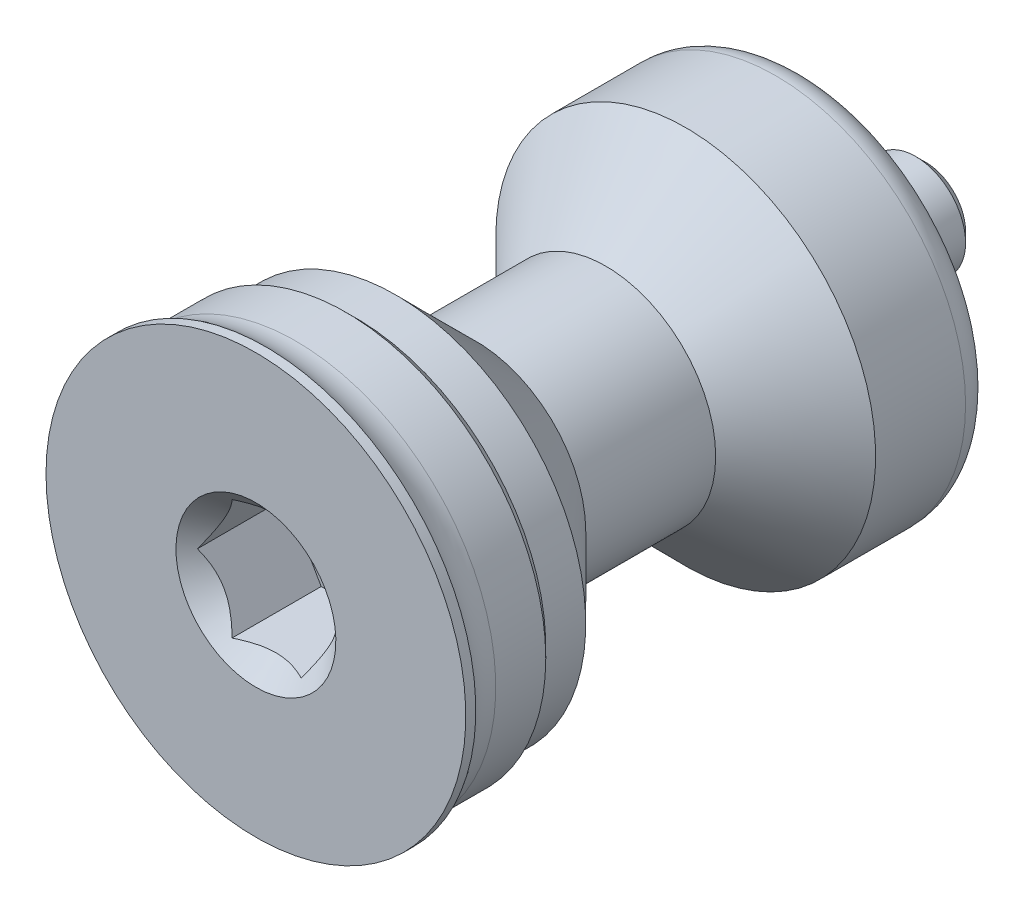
ISO-10303-21;
HEADER;
FILE_DESCRIPTION(('STEP AP214'),'2;1');
FILE_NAME('part.step','',(''),(''),'','','');
FILE_SCHEMA(('AUTOMOTIVE_DESIGN { 1 0 10303 214 1 1 1 1 }'));
ENDSEC;
DATA;
#1=APPLICATION_CONTEXT('core data for automotive mechanical design processes');
#2=APPLICATION_PROTOCOL_DEFINITION('international standard','automotive_design',2000,#1);
#3=PRODUCT_CONTEXT('',#1,'mechanical');
#4=PRODUCT('Part','Part','',(#3));
#5=PRODUCT_RELATED_PRODUCT_CATEGORY('part','',(#4));
#6=PRODUCT_DEFINITION_FORMATION('','',#4);
#7=PRODUCT_DEFINITION_CONTEXT('part definition',#1,'design');
#8=PRODUCT_DEFINITION('design','',#6,#7);
#9=PRODUCT_DEFINITION_SHAPE('','',#8);
#10=(LENGTH_UNIT() NAMED_UNIT(*) SI_UNIT(.MILLI.,.METRE.));
#11=(NAMED_UNIT(*) PLANE_ANGLE_UNIT() SI_UNIT($,.RADIAN.));
#12=(NAMED_UNIT(*) SI_UNIT($,.STERADIAN.) SOLID_ANGLE_UNIT());
#13=UNCERTAINTY_MEASURE_WITH_UNIT(LENGTH_MEASURE(1.E-05),#10,'distance_accuracy_value','');
#14=(GEOMETRIC_REPRESENTATION_CONTEXT(3) GLOBAL_UNCERTAINTY_ASSIGNED_CONTEXT((#13)) GLOBAL_UNIT_ASSIGNED_CONTEXT((#10,
#11,#12)) REPRESENTATION_CONTEXT('',''));
#15=CARTESIAN_POINT('',(0.,0.,0.));
#16=DIRECTION('',(0.,0.,1.));
#17=DIRECTION('',(1.,0.,0.));
#18=AXIS2_PLACEMENT_3D('',#15,#16,#17);
#19=CARTESIAN_POINT('',(0.,0.,25.5));
#20=DIRECTION('',(0.,0.,-1.));
#21=DIRECTION('',(-1.,0.,0.));
#22=AXIS2_PLACEMENT_3D('',#19,#20,#21);
#23=TOROIDAL_SURFACE('',#22,12.5,2.5);
#24=CARTESIAN_POINT('',(0.,0.,25.5));
#25=DIRECTION('',(0.,0.,-1.));
#26=DIRECTION('',(-1.,0.,0.));
#27=AXIS2_PLACEMENT_3D('',#24,#25,#26);
#28=CIRCLE('',#27,10.);
#29=CARTESIAN_POINT('',(-9.99999999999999,0.,25.5));
#30=VERTEX_POINT('',#29);
#31=EDGE_CURVE('E123',#30,#30,#28,.T.);
#32=ORIENTED_EDGE('',*,*,#31,.F.);
#33=EDGE_LOOP('',(#32));
#34=FACE_BOUND('',#33,.T.);
#35=CARTESIAN_POINT('',(0.,0.,27.));
#36=DIRECTION('',(0.,0.,-1.));
#37=DIRECTION('',(-1.,0.,0.));
#38=AXIS2_PLACEMENT_3D('',#35,#36,#37);
#39=CIRCLE('',#38,10.5);
#40=CARTESIAN_POINT('',(-10.5,0.,27.));
#41=VERTEX_POINT('',#40);
#42=EDGE_CURVE('E103',#41,#41,#39,.T.);
#43=ORIENTED_EDGE('',*,*,#42,.T.);
#44=EDGE_LOOP('',(#43));
#45=FACE_BOUND('',#44,.T.);
#46=ADVANCED_FACE('F14',(#34,#45),#23,.F.);
#47=CARTESIAN_POINT('',(0.,0.,-6.));
#48=DIRECTION('',(0.,0.,-1.));
#49=DIRECTION('',(-1.,0.,0.));
#50=AXIS2_PLACEMENT_3D('',#47,#48,#49);
#51=CYLINDRICAL_SURFACE('',#50,9.5);
#52=CARTESIAN_POINT('',(0.,0.,22.5));
#53=DIRECTION('',(0.,0.,-1.));
#54=DIRECTION('',(-1.,0.,0.));
#55=AXIS2_PLACEMENT_3D('',#52,#53,#54);
#56=CIRCLE('',#55,9.5);
#57=CARTESIAN_POINT('',(-9.49999999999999,0.,22.5));
#58=VERTEX_POINT('',#57);
#59=EDGE_CURVE('E126',#58,#58,#56,.T.);
#60=ORIENTED_EDGE('',*,*,#59,.T.);
#61=EDGE_LOOP('',(#60));
#62=FACE_BOUND('',#61,.T.);
#63=CARTESIAN_POINT('',(0.,0.,20.5));
#64=DIRECTION('',(0.,0.,-1.));
#65=DIRECTION('',(-1.,0.,0.));
#66=AXIS2_PLACEMENT_3D('',#63,#64,#65);
#67=CIRCLE('',#66,9.5);
#68=CARTESIAN_POINT('',(-9.5,0.,20.5));
#69=VERTEX_POINT('',#68);
#70=EDGE_CURVE('E107',#69,#69,#67,.T.);
#71=ORIENTED_EDGE('',*,*,#70,.F.);
#72=EDGE_LOOP('',(#71));
#73=FACE_BOUND('',#72,.T.);
#74=ADVANCED_FACE('F212',(#62,#73),#51,.T.);
#75=CARTESIAN_POINT('',(0.,0.,-6.));
#76=DIRECTION('',(0.,0.,-1.));
#77=DIRECTION('',(-1.,0.,0.));
#78=AXIS2_PLACEMENT_3D('',#75,#76,#77);
#79=CYLINDRICAL_SURFACE('',#78,10.);
#80=CARTESIAN_POINT('',(0.,0.,23.));
#81=DIRECTION('',(0.,0.,1.));
#82=DIRECTION('',(1.,0.,0.));
#83=AXIS2_PLACEMENT_3D('',#80,#81,#82);
#84=CIRCLE('',#83,10.);
#85=CARTESIAN_POINT('',(10.,0.,23.));
#86=VERTEX_POINT('',#85);
#87=EDGE_CURVE('E9',#86,#86,#84,.T.);
#88=ORIENTED_EDGE('',*,*,#87,.T.);
#89=EDGE_LOOP('',(#88));
#90=FACE_BOUND('',#89,.T.);
#91=ORIENTED_EDGE('',*,*,#31,.T.);
#92=EDGE_LOOP('',(#91));
#93=FACE_BOUND('',#92,.T.);
#94=ADVANCED_FACE('F218',(#90,#93),#79,.T.);
#95=CARTESIAN_POINT('',(0.,0.,6.));
#96=DIRECTION('',(0.,0.,-1.));
#97=DIRECTION('',(-1.,0.,0.));
#98=AXIS2_PLACEMENT_3D('',#95,#96,#97);
#99=CONICAL_SURFACE('',#98,9.5,0.78539816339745);
#100=CARTESIAN_POINT('',(0.,0.,10.));
#101=DIRECTION('',(0.,0.,-1.));
#102=DIRECTION('',(-1.,0.,0.));
#103=AXIS2_PLACEMENT_3D('',#100,#101,#102);
#104=CIRCLE('',#103,5.5);
#105=CARTESIAN_POINT('',(-5.5,0.,10.));
#106=VERTEX_POINT('',#105);
#107=EDGE_CURVE('E117',#106,#106,#104,.T.);
#108=ORIENTED_EDGE('',*,*,#107,.T.);
#109=EDGE_LOOP('',(#108));
#110=FACE_BOUND('',#109,.T.);
#111=CARTESIAN_POINT('',(0.,0.,6.));
#112=DIRECTION('',(0.,0.,-1.));
#113=DIRECTION('',(-1.,0.,0.));
#114=AXIS2_PLACEMENT_3D('',#111,#112,#113);
#115=CIRCLE('',#114,9.5);
#116=CARTESIAN_POINT('',(-9.5,0.,6.));
#117=VERTEX_POINT('',#116);
#118=EDGE_CURVE('E120',#117,#117,#115,.T.);
#119=ORIENTED_EDGE('',*,*,#118,.F.);
#120=EDGE_LOOP('',(#119));
#121=FACE_BOUND('',#120,.T.);
#122=ADVANCED_FACE('F226',(#110,#121),#99,.T.);
#123=CARTESIAN_POINT('',(0.,0.,0.));
#124=DIRECTION('',(0.,0.,-1.));
#125=DIRECTION('',(-1.,0.,0.));
#126=AXIS2_PLACEMENT_3D('',#123,#124,#125);
#127=CYLINDRICAL_SURFACE('',#126,5.5);
#128=CARTESIAN_POINT('',(0.,0.,16.5));
#129=DIRECTION('',(0.,0.,-1.));
#130=DIRECTION('',(-1.,0.,0.));
#131=AXIS2_PLACEMENT_3D('',#128,#129,#130);
#132=CIRCLE('',#131,5.5);
#133=CARTESIAN_POINT('',(-5.5,0.,16.5));
#134=VERTEX_POINT('',#133);
#135=EDGE_CURVE('E114',#134,#134,#132,.T.);
#136=ORIENTED_EDGE('',*,*,#135,.T.);
#137=EDGE_LOOP('',(#136));
#138=FACE_BOUND('',#137,.T.);
#139=ORIENTED_EDGE('',*,*,#107,.F.);
#140=EDGE_LOOP('',(#139));
#141=FACE_BOUND('',#140,.T.);
#142=ADVANCED_FACE('F240',(#138,#141),#127,.T.);
#143=CARTESIAN_POINT('',(0.,0.,16.5));
#144=DIRECTION('',(0.,0.,1.));
#145=DIRECTION('',(1.,0.,0.));
#146=AXIS2_PLACEMENT_3D('',#143,#144,#145);
#147=CONICAL_SURFACE('',#146,5.5,0.78539816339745);
#148=ORIENTED_EDGE('',*,*,#70,.T.);
#149=EDGE_LOOP('',(#148));
#150=FACE_BOUND('',#149,.T.);
#151=ORIENTED_EDGE('',*,*,#135,.F.);
#152=EDGE_LOOP('',(#151));
#153=FACE_BOUND('',#152,.T.);
#154=ADVANCED_FACE('F235',(#150,#153),#147,.T.);
#155=CARTESIAN_POINT('',(9.5,0.,0.));
#156=DIRECTION('',(0.,0.,1.));
#157=DIRECTION('',(1.,0.,0.));
#158=AXIS2_PLACEMENT_3D('',#155,#156,#157);
#159=PLANE('',#158);
#160=CARTESIAN_POINT('',(0.,0.,0.));
#161=DIRECTION('',(0.,0.,1.));
#162=DIRECTION('',(1.,0.,0.));
#163=AXIS2_PLACEMENT_3D('',#160,#161,#162);
#164=CIRCLE('',#163,3.);
#165=CARTESIAN_POINT('',(3.,0.,0.));
#166=VERTEX_POINT('',#165);
#167=EDGE_CURVE('E179',#166,#166,#164,.T.);
#168=ORIENTED_EDGE('',*,*,#167,.T.);
#169=EDGE_LOOP('',(#168));
#170=FACE_BOUND('',#169,.T.);
#171=CARTESIAN_POINT('',(0.,0.,0.));
#172=DIRECTION('',(0.,0.,1.));
#173=DIRECTION('',(1.,0.,0.));
#174=AXIS2_PLACEMENT_3D('',#171,#172,#173);
#175=CIRCLE('',#174,8.);
#176=CARTESIAN_POINT('',(8.,0.,0.));
#177=VERTEX_POINT('',#176);
#178=EDGE_CURVE('E164',#177,#177,#175,.F.);
#179=ORIENTED_EDGE('',*,*,#178,.T.);
#180=EDGE_LOOP('',(#179));
#181=FACE_BOUND('',#180,.T.);
#182=ADVANCED_FACE('F232',(#170,#181),#159,.F.);
#183=CARTESIAN_POINT('',(0.,0.,1.5));
#184=DIRECTION('',(0.,0.,1.));
#185=DIRECTION('',(1.,0.,0.));
#186=AXIS2_PLACEMENT_3D('',#183,#184,#185);
#187=CIRCLE('',#186,9.5);
#188=CARTESIAN_POINT('',(9.5,0.,1.5));
#189=VERTEX_POINT('',#188);
#190=EDGE_CURVE('E173',#189,#189,#187,.T.);
#191=ORIENTED_EDGE('',*,*,#190,.T.);
#192=EDGE_LOOP('',(#191));
#193=FACE_BOUND('',#192,.T.);
#194=ORIENTED_EDGE('',*,*,#118,.T.);
#195=EDGE_LOOP('',(#194));
#196=FACE_BOUND('',#195,.T.);
#197=ADVANCED_FACE('F221',(#193,#196),#51,.T.);
#198=CARTESIAN_POINT('',(0.,0.,-3.));
#199=DIRECTION('',(0.,0.,-1.));
#200=DIRECTION('',(-1.,0.,0.));
#201=AXIS2_PLACEMENT_3D('',#198,#199,#200);
#202=CONICAL_SURFACE('',#201,2.5,0.47123889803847);
#203=CARTESIAN_POINT('',(0.,0.,-2.01869474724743));
#204=DIRECTION('',(0.,0.,-1.));
#205=DIRECTION('',(-1.,0.,0.));
#206=AXIS2_PLACEMENT_3D('',#203,#204,#205);
#207=CIRCLE('',#206,2.);
#208=CARTESIAN_POINT('',(-2.,0.,-2.01869474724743));
#209=VERTEX_POINT('',#208);
#210=EDGE_CURVE('E98',#209,#209,#207,.T.);
#211=ORIENTED_EDGE('',*,*,#210,.T.);
#212=EDGE_LOOP('',(#211));
#213=FACE_BOUND('',#212,.T.);
#214=CARTESIAN_POINT('',(0.,0.,-3.));
#215=DIRECTION('',(0.,0.,-1.));
#216=DIRECTION('',(-1.,0.,0.));
#217=AXIS2_PLACEMENT_3D('',#214,#215,#216);
#218=CIRCLE('',#217,2.5);
#219=CARTESIAN_POINT('',(-2.5,0.,-3.));
#220=VERTEX_POINT('',#219);
#221=EDGE_CURVE('E104',#220,#220,#218,.T.);
#222=ORIENTED_EDGE('',*,*,#221,.F.);
#223=EDGE_LOOP('',(#222));
#224=FACE_BOUND('',#223,.T.);
#225=ADVANCED_FACE('F207',(#213,#224),#202,.T.);
#226=CARTESIAN_POINT('',(0.,0.,0.));
#227=DIRECTION('',(0.,0.,-1.));
#228=DIRECTION('',(-1.,0.,0.));
#229=AXIS2_PLACEMENT_3D('',#226,#227,#228);
#230=CYLINDRICAL_SURFACE('',#229,2.);
#231=CARTESIAN_POINT('',(0.,0.,-1.));
#232=DIRECTION('',(0.,0.,1.));
#233=DIRECTION('',(1.,0.,0.));
#234=AXIS2_PLACEMENT_3D('',#231,#232,#233);
#235=CIRCLE('',#234,2.);
#236=CARTESIAN_POINT('',(2.,0.,-1.));
#237=VERTEX_POINT('',#236);
#238=EDGE_CURVE('E176',#237,#237,#235,.F.);
#239=ORIENTED_EDGE('',*,*,#238,.T.);
#240=EDGE_LOOP('',(#239));
#241=FACE_BOUND('',#240,.T.);
#242=ORIENTED_EDGE('',*,*,#210,.F.);
#243=EDGE_LOOP('',(#242));
#244=FACE_BOUND('',#243,.T.);
#245=ADVANCED_FACE('F198',(#241,#244),#230,.T.);
#246=CARTESIAN_POINT('',(2.5,0.,-6.));
#247=DIRECTION('',(0.,0.,1.));
#248=DIRECTION('',(1.,0.,0.));
#249=AXIS2_PLACEMENT_3D('',#246,#247,#248);
#250=PLANE('',#249);
#251=CARTESIAN_POINT('',(0.,0.,-6.));
#252=DIRECTION('',(0.,0.,1.));
#253=DIRECTION('',(1.,0.,0.));
#254=AXIS2_PLACEMENT_3D('',#251,#252,#253);
#255=CIRCLE('',#254,2.);
#256=CARTESIAN_POINT('',(2.,0.,-6.));
#257=VERTEX_POINT('',#256);
#258=EDGE_CURVE('E182',#257,#257,#255,.F.);
#259=ORIENTED_EDGE('',*,*,#258,.T.);
#260=EDGE_LOOP('',(#259));
#261=FACE_BOUND('',#260,.T.);
#262=ADVANCED_FACE('F196',(#261),#250,.F.);
#263=CARTESIAN_POINT('',(0.,0.,-6.));
#264=DIRECTION('',(0.,0.,-1.));
#265=DIRECTION('',(-1.,0.,0.));
#266=AXIS2_PLACEMENT_3D('',#263,#264,#265);
#267=CYLINDRICAL_SURFACE('',#266,2.5);
#268=CARTESIAN_POINT('',(0.,0.,-5.5));
#269=DIRECTION('',(0.,0.,1.));
#270=DIRECTION('',(1.,0.,0.));
#271=AXIS2_PLACEMENT_3D('',#268,#269,#270);
#272=CIRCLE('',#271,2.5);
#273=CARTESIAN_POINT('',(2.5,0.,-5.5));
#274=VERTEX_POINT('',#273);
#275=EDGE_CURVE('E22',#274,#274,#272,.T.);
#276=ORIENTED_EDGE('',*,*,#275,.T.);
#277=EDGE_LOOP('',(#276));
#278=FACE_BOUND('',#277,.T.);
#279=ORIENTED_EDGE('',*,*,#221,.T.);
#280=EDGE_LOOP('',(#279));
#281=FACE_BOUND('',#280,.T.);
#282=ADVANCED_FACE('F187',(#278,#281),#267,.T.);
#283=CARTESIAN_POINT('',(0.,0.,0.));
#284=DIRECTION('',(0.,0.,-1.));
#285=DIRECTION('',(-1.,0.,0.));
#286=AXIS2_PLACEMENT_3D('',#283,#284,#285);
#287=CYLINDRICAL_SURFACE('',#286,10.5);
#288=CARTESIAN_POINT('',(0.,0.,27.5));
#289=DIRECTION('',(0.,0.,-1.));
#290=DIRECTION('',(-1.,0.,0.));
#291=AXIS2_PLACEMENT_3D('',#288,#289,#290);
#292=CIRCLE('',#291,10.5);
#293=CARTESIAN_POINT('',(-10.5,0.,27.5));
#294=VERTEX_POINT('',#293);
#295=EDGE_CURVE('E100',#294,#294,#292,.T.);
#296=ORIENTED_EDGE('',*,*,#295,.T.);
#297=EDGE_LOOP('',(#296));
#298=FACE_BOUND('',#297,.T.);
#299=ORIENTED_EDGE('',*,*,#42,.F.);
#300=EDGE_LOOP('',(#299));
#301=FACE_BOUND('',#300,.T.);
#302=ADVANCED_FACE('F205',(#298,#301),#287,.T.);
#303=CARTESIAN_POINT('',(0.,0.,27.5));
#304=DIRECTION('',(0.,0.,1.));
#305=DIRECTION('',(1.,0.,0.));
#306=AXIS2_PLACEMENT_3D('',#303,#304,#305);
#307=PLANE('',#306);
#308=CARTESIAN_POINT('',(0.,0.,27.5));
#309=DIRECTION('',(0.,0.,1.));
#310=DIRECTION('',(0.,-1.,0.));
#311=AXIS2_PLACEMENT_3D('',#308,#309,#310);
#312=CIRCLE('',#311,4.);
#313=CARTESIAN_POINT('',(0.,-4.,27.5));
#314=VERTEX_POINT('',#313);
#315=EDGE_CURVE('E95',#314,#314,#312,.T.);
#316=ORIENTED_EDGE('',*,*,#315,.F.);
#317=EDGE_LOOP('',(#316));
#318=FACE_BOUND('',#317,.T.);
#319=ORIENTED_EDGE('',*,*,#295,.F.);
#320=EDGE_LOOP('',(#319));
#321=FACE_BOUND('',#320,.T.);
#322=ADVANCED_FACE('F273',(#318,#321),#307,.T.);
#323=CARTESIAN_POINT('',(0.,0.,27.5));
#324=DIRECTION('',(0.,0.,1.));
#325=DIRECTION('',(0.,-1.,0.));
#326=AXIS2_PLACEMENT_3D('',#323,#324,#325);
#327=CONICAL_SURFACE('',#326,4.,0.78539816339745);
#328=CARTESIAN_POINT('',(1.73193533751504,3.0002,26.9642170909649));
#329=CARTESIAN_POINT('',(1.79147372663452,2.89707648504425,26.9047299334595));
#330=CARTESIAN_POINT('',(1.85200767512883,2.79222861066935,26.8487365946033));
#331=CARTESIAN_POINT('',(1.97544301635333,2.57843232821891,26.7462142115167));
#332=CARTESIAN_POINT('',(2.03835614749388,2.46946358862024,26.6997422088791));
#333=CARTESIAN_POINT('',(2.16521745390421,2.24973336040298,26.6201348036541));
#334=CARTESIAN_POINT('',(2.22913332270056,2.13902782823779,26.5867993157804));
#335=CARTESIAN_POINT('',(2.35837216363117,1.91517958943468,26.5354391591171));
#336=CARTESIAN_POINT('',(2.42369118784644,1.80204372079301,26.5173761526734));
#337=CARTESIAN_POINT('',(2.53626564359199,1.6070590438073,26.5010785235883));
#338=CARTESIAN_POINT('',(2.58337569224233,1.52546204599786,26.4986659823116));
#339=CARTESIAN_POINT('',(2.67751916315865,1.36240077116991,26.5027310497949));
#340=CARTESIAN_POINT('',(2.7245525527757,1.28093655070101,26.5092117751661));
#341=CARTESIAN_POINT('',(2.81817374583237,1.11877988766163,26.530693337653));
#342=CARTESIAN_POINT('',(2.86476099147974,1.0380884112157,26.545703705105));
#343=CARTESIAN_POINT('',(2.95713536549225,0.878091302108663,26.5834252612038));
#344=CARTESIAN_POINT('',(3.00292255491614,0.798785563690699,26.6061358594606));
#345=CARTESIAN_POINT('',(3.0842086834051,0.657993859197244,26.6528622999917));
#346=CARTESIAN_POINT('',(3.11988753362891,0.596196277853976,26.6756499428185));
#347=CARTESIAN_POINT('',(3.19060468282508,0.473710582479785,26.7248979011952));
#348=CARTESIAN_POINT('',(3.22564296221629,0.4130225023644,26.751358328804));
#349=CARTESIAN_POINT('',(3.29496858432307,0.292947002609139,26.8073586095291));
#350=CARTESIAN_POINT('',(3.3292578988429,0.233556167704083,26.8368887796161));
#351=CARTESIAN_POINT('',(3.39720147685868,0.115874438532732,26.8986407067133));
#352=CARTESIAN_POINT('',(3.43085611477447,0.0575828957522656,26.9308608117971));
#353=CARTESIAN_POINT('',(3.4642170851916,-0.000200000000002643,26.9642170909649));
#354=B_SPLINE_CURVE_WITH_KNOTS('',3,(#328,#329,#330,#331,#332,#333,#334,#335,#336,#337,#338,
#339,#340,#341,#342,#343,#344,#345,#346,#347,#348,#349,#350,#351,#352,#353),.UNSPECIFIED.,.F.,
.F.,(4,2,2,2,2,2,2,2,2,2,2,2,4),(0.,0.399603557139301,0.801535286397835,1.19708369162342,
1.59163620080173,1.87398941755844,2.15644160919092,2.43921001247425,2.72195674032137,
2.94657516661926,3.17120044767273,3.3951375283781,3.61893808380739),.UNSPECIFIED.);
#355=CARTESIAN_POINT('',(1.73205080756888,3.,26.9641016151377));
#356=VERTEX_POINT('',#355);
#357=CARTESIAN_POINT('',(3.46410161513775,0.,26.9641016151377));
#358=VERTEX_POINT('',#357);
#359=EDGE_CURVE('E129',#356,#358,#354,.T.);
#360=ORIENTED_EDGE('',*,*,#359,.T.);
#361=CARTESIAN_POINT('',(3.4642170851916,0.000199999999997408,26.9642170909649));
#362=CARTESIAN_POINT('',(3.40467869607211,-0.102923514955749,26.9047299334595));
#363=CARTESIAN_POINT('',(3.3441447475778,-0.207771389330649,26.8487365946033));
#364=CARTESIAN_POINT('',(3.2207094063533,-0.421567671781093,26.7462142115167));
#365=CARTESIAN_POINT('',(3.15779627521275,-0.530536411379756,26.6997422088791));
#366=CARTESIAN_POINT('',(3.03093496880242,-0.750266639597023,26.6201348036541));
#367=CARTESIAN_POINT('',(2.96701910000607,-0.860972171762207,26.5867993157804));
#368=CARTESIAN_POINT('',(2.83778025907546,-1.08482041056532,26.5354391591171));
#369=CARTESIAN_POINT('',(2.7724612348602,-1.19795627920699,26.5173761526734));
#370=CARTESIAN_POINT('',(2.65988677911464,-1.3929409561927,26.5010785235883));
#371=CARTESIAN_POINT('',(2.6127767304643,-1.47453795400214,26.4986659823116));
#372=CARTESIAN_POINT('',(2.51863325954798,-1.63759922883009,26.5027310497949));
#373=CARTESIAN_POINT('',(2.47159986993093,-1.71906344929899,26.5092117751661));
#374=CARTESIAN_POINT('',(2.37797867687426,-1.88122011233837,26.530693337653));
#375=CARTESIAN_POINT('',(2.33139143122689,-1.9619115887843,26.545703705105));
#376=CARTESIAN_POINT('',(2.23901705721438,-2.12190869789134,26.5834252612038));
#377=CARTESIAN_POINT('',(2.19322986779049,-2.2012144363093,26.6061358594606));
#378=CARTESIAN_POINT('',(2.11194373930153,-2.34200614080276,26.6528622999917));
#379=CARTESIAN_POINT('',(2.07626488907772,-2.40380372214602,26.6756499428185));
#380=CARTESIAN_POINT('',(2.00554773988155,-2.52628941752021,26.7248979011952));
#381=CARTESIAN_POINT('',(1.97050946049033,-2.5869774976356,26.751358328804));
#382=CARTESIAN_POINT('',(1.90118383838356,-2.70705299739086,26.8073586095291));
#383=CARTESIAN_POINT('',(1.86689452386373,-2.76644383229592,26.8368887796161));
#384=CARTESIAN_POINT('',(1.79895094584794,-2.88412556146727,26.8986407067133));
#385=CARTESIAN_POINT('',(1.76529630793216,-2.94241710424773,26.9308608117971));
#386=CARTESIAN_POINT('',(1.73193533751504,-3.0002,26.9642170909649));
#387=B_SPLINE_CURVE_WITH_KNOTS('',3,(#361,#362,#363,#364,#365,#366,#367,#368,#369,#370,#371,
#372,#373,#374,#375,#376,#377,#378,#379,#380,#381,#382,#383,#384,#385,#386),.UNSPECIFIED.,.F.,
.F.,(4,2,2,2,2,2,2,2,2,2,2,2,4),(0.,0.399603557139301,0.801535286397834,1.19708369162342,
1.59163620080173,1.87398941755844,2.15644160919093,2.43921001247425,2.72195674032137,
2.94657516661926,3.17120044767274,3.39513752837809,3.61893808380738),.UNSPECIFIED.);
#388=CARTESIAN_POINT('',(1.73205080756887,-3.,26.9641016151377));
#389=VERTEX_POINT('',#388);
#390=EDGE_CURVE('E29',#358,#389,#387,.T.);
#391=ORIENTED_EDGE('',*,*,#390,.T.);
#392=CARTESIAN_POINT('',(-4.37758920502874,-3.,28.8069093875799));
#393=CARTESIAN_POINT('',(-4.2674111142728,-3.,28.716048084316));
#394=CARTESIAN_POINT('',(-4.15671173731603,-3.,28.6258090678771));
#395=CARTESIAN_POINT('',(-3.93400120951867,-3.,28.4469083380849));
#396=CARTESIAN_POINT('',(-3.82198973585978,-3.,28.3582470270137));
#397=CARTESIAN_POINT('',(-3.59519525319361,-3.,28.1819119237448));
#398=CARTESIAN_POINT('',(-3.48039529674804,-3.,28.0942598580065));
#399=CARTESIAN_POINT('',(-3.2489191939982,-3.,27.921486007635));
#400=CARTESIAN_POINT('',(-3.13224323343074,-3.,27.8363639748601));
#401=CARTESIAN_POINT('',(-2.88518326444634,-3.,27.661244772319));
#402=CARTESIAN_POINT('',(-2.75456636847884,-3.,27.5715743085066));
#403=CARTESIAN_POINT('',(-2.4898618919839,-3.,27.3973671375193));
#404=CARTESIAN_POINT('',(-2.355773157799,-3.,27.3128321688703));
#405=CARTESIAN_POINT('',(-2.08400272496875,-3.,27.1511888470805));
#406=CARTESIAN_POINT('',(-1.94634079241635,-3.,27.0740475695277));
#407=CARTESIAN_POINT('',(-1.666054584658,-3.,26.9294801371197));
#408=CARTESIAN_POINT('',(-1.52343486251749,-3.,26.8620453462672));
#409=CARTESIAN_POINT('',(-1.2756469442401,-3.,26.7586271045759));
#410=CARTESIAN_POINT('',(-1.17190723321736,-3.,26.7192457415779));
#411=CARTESIAN_POINT('',(-0.961582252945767,-3.,26.6487820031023));
#412=CARTESIAN_POINT('',(-0.854996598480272,-3.,26.6177007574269));
#413=CARTESIAN_POINT('',(-0.641800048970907,-3.,26.5661810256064));
#414=CARTESIAN_POINT('',(-0.535244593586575,-3.,26.5455170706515));
#415=CARTESIAN_POINT('',(-0.320567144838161,-3.,26.5152100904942));
#416=CARTESIAN_POINT('',(-0.212445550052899,-3.,26.5055643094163));
#417=CARTESIAN_POINT('',(-0.00171488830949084,-3.,26.498253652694));
#418=CARTESIAN_POINT('',(0.100872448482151,-3.,26.4999627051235));
#419=CARTESIAN_POINT('',(0.305338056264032,-3.,26.5137721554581));
#420=CARTESIAN_POINT('',(0.407216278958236,-3.,26.5258732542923));
#421=CARTESIAN_POINT('',(0.611312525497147,-3.,26.5599624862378));
#422=CARTESIAN_POINT('',(0.713498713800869,-3.,26.5821380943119));
#423=CARTESIAN_POINT('',(0.915568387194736,-3.,26.6350847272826));
#424=CARTESIAN_POINT('',(1.0154518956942,-3.,26.6658556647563));
#425=CARTESIAN_POINT('',(1.31490686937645,-3.,26.7700818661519));
#426=CARTESIAN_POINT('',(1.51058763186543,-3.,26.8547390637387));
#427=CARTESIAN_POINT('',(1.79700915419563,-3.,26.9960481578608));
#428=CARTESIAN_POINT('',(1.89147149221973,-3.,27.0456457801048));
#429=CARTESIAN_POINT('',(2.07826448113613,-3.,27.1487133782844));
#430=CARTESIAN_POINT('',(2.17059549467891,-3.,27.2021826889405));
#431=CARTESIAN_POINT('',(2.34885309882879,-3.,27.3095016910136));
#432=CARTESIAN_POINT('',(2.43487067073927,-3.,27.3632019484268));
#433=CARTESIAN_POINT('',(2.60542960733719,-3.,27.4729084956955));
#434=CARTESIAN_POINT('',(2.68997086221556,-3.,27.5289149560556));
#435=CARTESIAN_POINT('',(2.85709507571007,-3.,27.642372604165));
#436=CARTESIAN_POINT('',(2.9396882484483,-3.,27.6998088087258));
#437=CARTESIAN_POINT('',(3.10373883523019,-3.,27.8162355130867));
#438=CARTESIAN_POINT('',(3.18519655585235,-3.,27.8752255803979));
#439=CARTESIAN_POINT('',(3.26617756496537,-3.,27.9348524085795));
#440=B_SPLINE_CURVE_WITH_KNOTS('',3,(#392,#393,#394,#395,#396,#397,#398,#399,#400,#401,#402,
#403,#404,#405,#406,#407,#408,#409,#410,#411,#412,#413,#414,#415,#416,#417,#418,#419,#420,#421,
#422,#423,#424,#425,#426,#427,#428,#429,#430,#431,#432,#433,#434,#435,#436,#437,#438,#439),
.UNSPECIFIED.,.F.,.F.,(4,2,2,2,2,2,2,2,2,2,2,2,2,2,2,2,2,2,2,2,2,2,2,4),(0.,0.428440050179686,
0.856987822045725,1.29026938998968,1.72350832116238,2.1987222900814,2.67409624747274,
3.14724406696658,3.61996828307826,3.95258153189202,4.28524003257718,4.61035100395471,
4.9353806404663,5.24264372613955,5.54992753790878,5.86317986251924,6.17642900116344,
6.81409574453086,7.13414115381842,7.45413169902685,7.75830573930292,8.06250230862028,
8.36428600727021,8.6659865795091),.UNSPECIFIED.);
#441=CARTESIAN_POINT('',(-1.73205080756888,-3.,26.9641016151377));
#442=VERTEX_POINT('',#441);
#443=EDGE_CURVE('E37',#389,#442,#440,.F.);
#444=ORIENTED_EDGE('',*,*,#443,.T.);
#445=CARTESIAN_POINT('',(-1.73193533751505,-3.0002,26.9642170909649));
#446=CARTESIAN_POINT('',(-1.79147372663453,-2.89707648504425,26.9047299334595));
#447=CARTESIAN_POINT('',(-1.85200767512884,-2.79222861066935,26.8487365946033));
#448=CARTESIAN_POINT('',(-1.97544301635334,-2.5784323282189,26.7462142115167));
#449=CARTESIAN_POINT('',(-2.03835614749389,-2.46946358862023,26.699742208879));
#450=CARTESIAN_POINT('',(-2.16521745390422,-2.24973336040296,26.6201348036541));
#451=CARTESIAN_POINT('',(-2.22913332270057,-2.13902782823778,26.5867993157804));
#452=CARTESIAN_POINT('',(-2.35837216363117,-1.91517958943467,26.5354391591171));
#453=CARTESIAN_POINT('',(-2.42369118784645,-1.80204372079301,26.5173761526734));
#454=CARTESIAN_POINT('',(-2.536265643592,-1.6070590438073,26.5010785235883));
#455=CARTESIAN_POINT('',(-2.58337569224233,-1.52546204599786,26.4986659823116));
#456=CARTESIAN_POINT('',(-2.67751916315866,-1.3624007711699,26.5027310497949));
#457=CARTESIAN_POINT('',(-2.7245525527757,-1.28093655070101,26.5092117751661));
#458=CARTESIAN_POINT('',(-2.81817374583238,-1.11877988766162,26.530693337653));
#459=CARTESIAN_POINT('',(-2.86476099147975,-1.03808841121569,26.545703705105));
#460=CARTESIAN_POINT('',(-2.95713536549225,-0.878091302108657,26.5834252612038));
#461=CARTESIAN_POINT('',(-3.00292255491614,-0.7987855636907,26.6061358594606));
#462=CARTESIAN_POINT('',(-3.08420868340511,-0.657993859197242,26.6528622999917));
#463=CARTESIAN_POINT('',(-3.11988753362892,-0.596196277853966,26.6756499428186));
#464=CARTESIAN_POINT('',(-3.19060468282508,-0.473710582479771,26.7248979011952));
#465=CARTESIAN_POINT('',(-3.2256429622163,-0.41302250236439,26.751358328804));
#466=CARTESIAN_POINT('',(-3.29496858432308,-0.292947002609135,26.8073586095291));
#467=CARTESIAN_POINT('',(-3.32925789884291,-0.233556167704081,26.8368887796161));
#468=CARTESIAN_POINT('',(-3.39720147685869,-0.115874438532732,26.8986407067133));
#469=CARTESIAN_POINT('',(-3.43085611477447,-0.0575828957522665,26.9308608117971));
#470=CARTESIAN_POINT('',(-3.4642170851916,0.00019999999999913,26.9642170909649));
#471=B_SPLINE_CURVE_WITH_KNOTS('',3,(#445,#446,#447,#448,#449,#450,#451,#452,#453,#454,#455,
#456,#457,#458,#459,#460,#461,#462,#463,#464,#465,#466,#467,#468,#469,#470),.UNSPECIFIED.,.F.,
.F.,(4,2,2,2,2,2,2,2,2,2,2,2,4),(0.,0.39960355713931,0.801535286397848,1.19708369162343,
1.59163620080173,1.87398941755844,2.15644160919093,2.43921001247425,2.72195674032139,
2.94657516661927,3.17120044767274,3.39513752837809,3.61893808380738),.UNSPECIFIED.);
#472=CARTESIAN_POINT('',(-3.46410161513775,0.,26.9641016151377));
#473=VERTEX_POINT('',#472);
#474=EDGE_CURVE('E312',#442,#473,#471,.T.);
#475=ORIENTED_EDGE('',*,*,#474,.T.);
#476=CARTESIAN_POINT('',(-3.4642170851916,-0.000200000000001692,26.9642170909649));
#477=CARTESIAN_POINT('',(-3.40467869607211,0.10292351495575,26.9047299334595));
#478=CARTESIAN_POINT('',(-3.3441447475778,0.207771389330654,26.8487365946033));
#479=CARTESIAN_POINT('',(-3.22070940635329,0.421567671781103,26.7462142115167));
#480=CARTESIAN_POINT('',(-3.15779627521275,0.530536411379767,26.699742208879));
#481=CARTESIAN_POINT('',(-3.03093496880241,0.750266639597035,26.6201348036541));
#482=CARTESIAN_POINT('',(-2.96701910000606,0.860972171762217,26.5867993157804));
#483=CARTESIAN_POINT('',(-2.83778025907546,1.08482041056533,26.5354391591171));
#484=CARTESIAN_POINT('',(-2.77246123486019,1.197956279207,26.5173761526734));
#485=CARTESIAN_POINT('',(-2.65988677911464,1.3929409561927,26.5010785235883));
#486=CARTESIAN_POINT('',(-2.6127767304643,1.47453795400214,26.4986659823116));
#487=CARTESIAN_POINT('',(-2.51863325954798,1.63759922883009,26.5027310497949));
#488=CARTESIAN_POINT('',(-2.47159986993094,1.71906344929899,26.5092117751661));
#489=CARTESIAN_POINT('',(-2.37797867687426,1.88122011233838,26.530693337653));
#490=CARTESIAN_POINT('',(-2.33139143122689,1.96191158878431,26.545703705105));
#491=CARTESIAN_POINT('',(-2.23901705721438,2.12190869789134,26.5834252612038));
#492=CARTESIAN_POINT('',(-2.19322986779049,2.2012144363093,26.6061358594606));
#493=CARTESIAN_POINT('',(-2.11194373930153,2.34200614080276,26.6528622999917));
#494=CARTESIAN_POINT('',(-2.07626488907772,2.40380372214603,26.6756499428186));
#495=CARTESIAN_POINT('',(-2.00554773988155,2.52628941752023,26.7248979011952));
#496=CARTESIAN_POINT('',(-1.97050946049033,2.58697749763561,26.751358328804));
#497=CARTESIAN_POINT('',(-1.90118383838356,2.70705299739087,26.8073586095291));
#498=CARTESIAN_POINT('',(-1.86689452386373,2.76644383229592,26.8368887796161));
#499=CARTESIAN_POINT('',(-1.79895094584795,2.88412556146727,26.8986407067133));
#500=CARTESIAN_POINT('',(-1.76529630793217,2.94241710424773,26.9308608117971));
#501=CARTESIAN_POINT('',(-1.73193533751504,3.0002,26.9642170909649));
#502=B_SPLINE_CURVE_WITH_KNOTS('',3,(#476,#477,#478,#479,#480,#481,#482,#483,#484,#485,#486,
#487,#488,#489,#490,#491,#492,#493,#494,#495,#496,#497,#498,#499,#500,#501),.UNSPECIFIED.,.F.,
.F.,(4,2,2,2,2,2,2,2,2,2,2,2,4),(0.,0.399603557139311,0.801535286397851,1.19708369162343,
1.59163620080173,1.87398941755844,2.15644160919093,2.43921001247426,2.72195674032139,
2.94657516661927,3.17120044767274,3.3951375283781,3.61893808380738),.UNSPECIFIED.);
#503=CARTESIAN_POINT('',(-1.73205080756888,3.,26.9641016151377));
#504=VERTEX_POINT('',#503);
#505=EDGE_CURVE('E310',#473,#504,#502,.T.);
#506=ORIENTED_EDGE('',*,*,#505,.T.);
#507=CARTESIAN_POINT('',(-4.37758920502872,3.,28.8069093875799));
#508=CARTESIAN_POINT('',(-4.26741111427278,3.,28.716048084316));
#509=CARTESIAN_POINT('',(-4.156711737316,3.,28.6258090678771));
#510=CARTESIAN_POINT('',(-3.93400120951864,3.,28.4469083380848));
#511=CARTESIAN_POINT('',(-3.82198973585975,3.,28.3582470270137));
#512=CARTESIAN_POINT('',(-3.59519525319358,3.,28.1819119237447));
#513=CARTESIAN_POINT('',(-3.48039529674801,3.,28.0942598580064));
#514=CARTESIAN_POINT('',(-3.24891919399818,3.,27.921486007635));
#515=CARTESIAN_POINT('',(-3.13224323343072,3.,27.8363639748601));
#516=CARTESIAN_POINT('',(-2.88518326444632,3.,27.661244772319));
#517=CARTESIAN_POINT('',(-2.75456636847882,3.,27.5715743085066));
#518=CARTESIAN_POINT('',(-2.48986189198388,3.,27.3973671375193));
#519=CARTESIAN_POINT('',(-2.35577315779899,3.,27.3128321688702));
#520=CARTESIAN_POINT('',(-2.08400272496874,3.,27.1511888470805));
#521=CARTESIAN_POINT('',(-1.94634079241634,3.,27.0740475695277));
#522=CARTESIAN_POINT('',(-1.66605458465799,3.,26.9294801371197));
#523=CARTESIAN_POINT('',(-1.52343486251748,3.,26.8620453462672));
#524=CARTESIAN_POINT('',(-1.2756469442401,3.,26.7586271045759));
#525=CARTESIAN_POINT('',(-1.17190723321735,3.,26.7192457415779));
#526=CARTESIAN_POINT('',(-0.961582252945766,3.,26.6487820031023));
#527=CARTESIAN_POINT('',(-0.854996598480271,3.,26.6177007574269));
#528=CARTESIAN_POINT('',(-0.641800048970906,3.,26.5661810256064));
#529=CARTESIAN_POINT('',(-0.535244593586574,3.,26.5455170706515));
#530=CARTESIAN_POINT('',(-0.320567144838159,3.,26.5152100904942));
#531=CARTESIAN_POINT('',(-0.212445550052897,3.,26.5055643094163));
#532=CARTESIAN_POINT('',(-0.0017148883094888,3.,26.498253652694));
#533=CARTESIAN_POINT('',(0.100872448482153,3.,26.4999627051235));
#534=CARTESIAN_POINT('',(0.305338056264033,3.,26.5137721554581));
#535=CARTESIAN_POINT('',(0.407216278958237,3.,26.5258732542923));
#536=CARTESIAN_POINT('',(0.611312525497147,3.,26.5599624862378));
#537=CARTESIAN_POINT('',(0.71349871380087,3.,26.5821380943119));
#538=CARTESIAN_POINT('',(0.915568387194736,3.,26.6350847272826));
#539=CARTESIAN_POINT('',(1.0154518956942,3.,26.6658556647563));
#540=CARTESIAN_POINT('',(1.31490686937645,3.,26.7700818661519));
#541=CARTESIAN_POINT('',(1.51058763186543,3.,26.8547390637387));
#542=CARTESIAN_POINT('',(1.79700915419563,3.,26.9960481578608));
#543=CARTESIAN_POINT('',(1.89147149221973,3.,27.0456457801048));
#544=CARTESIAN_POINT('',(2.07826448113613,3.,27.1487133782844));
#545=CARTESIAN_POINT('',(2.17059549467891,3.,27.2021826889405));
#546=CARTESIAN_POINT('',(2.34885309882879,3.,27.3095016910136));
#547=CARTESIAN_POINT('',(2.43487067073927,3.,27.3632019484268));
#548=CARTESIAN_POINT('',(2.60542960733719,3.,27.4729084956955));
#549=CARTESIAN_POINT('',(2.68997086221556,3.,27.5289149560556));
#550=CARTESIAN_POINT('',(2.85709507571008,3.,27.642372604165));
#551=CARTESIAN_POINT('',(2.93968824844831,3.,27.6998088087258));
#552=CARTESIAN_POINT('',(3.1037388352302,3.,27.8162355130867));
#553=CARTESIAN_POINT('',(3.18519655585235,3.,27.8752255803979));
#554=CARTESIAN_POINT('',(3.26617756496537,3.,27.9348524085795));
#555=B_SPLINE_CURVE_WITH_KNOTS('',3,(#507,#508,#509,#510,#511,#512,#513,#514,#515,#516,#517,
#518,#519,#520,#521,#522,#523,#524,#525,#526,#527,#528,#529,#530,#531,#532,#533,#534,#535,#536,
#537,#538,#539,#540,#541,#542,#543,#544,#545,#546,#547,#548,#549,#550,#551,#552,#553,#554),
.UNSPECIFIED.,.F.,.F.,(4,2,2,2,2,2,2,2,2,2,2,2,2,2,2,2,2,2,2,2,2,2,2,4),(0.,0.428440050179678,
0.856987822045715,1.29026938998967,1.72350832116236,2.19872229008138,2.67409624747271,
3.14724406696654,3.61996828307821,3.95258153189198,4.28524003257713,4.61035100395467,
4.93538064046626,5.2426437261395,5.54992753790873,5.8631798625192,6.17642900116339,
6.81409574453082,7.13414115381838,7.4541316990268,7.75830573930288,8.06250230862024,
8.36428600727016,8.66598657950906),.UNSPECIFIED.);
#556=EDGE_CURVE('E137',#504,#356,#555,.T.);
#557=ORIENTED_EDGE('',*,*,#556,.T.);
#558=EDGE_LOOP('',(#360,#391,#444,#475,#506,#557));
#559=FACE_BOUND('',#558,.T.);
#560=ORIENTED_EDGE('',*,*,#315,.T.);
#561=EDGE_LOOP('',(#560));
#562=FACE_BOUND('',#561,.T.);
#563=ADVANCED_FACE('F144',(#559,#562),#327,.F.);
#564=CARTESIAN_POINT('',(0.,0.,22.5));
#565=DIRECTION('',(0.,0.,1.));
#566=DIRECTION('',(0.,-1.,0.));
#567=AXIS2_PLACEMENT_3D('',#564,#565,#566);
#568=PLANE('',#567);
#569=DIRECTION('',(0.5,-0.866025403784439,0.));
#570=VECTOR('',#569,1.);
#571=CARTESIAN_POINT('',(-3.46410161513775,0.,22.5));
#572=LINE('',#571,#570);
#573=CARTESIAN_POINT('',(-3.46410161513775,0.,22.5));
#574=VERTEX_POINT('',#573);
#575=CARTESIAN_POINT('',(-1.73205080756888,-3.,22.5));
#576=VERTEX_POINT('',#575);
#577=EDGE_CURVE('E91',#574,#576,#572,.T.);
#578=ORIENTED_EDGE('',*,*,#577,.T.);
#579=DIRECTION('',(1.,0.,0.));
#580=VECTOR('',#579,1.);
#581=CARTESIAN_POINT('',(-1.73205080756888,-3.,22.5));
#582=LINE('',#581,#580);
#583=CARTESIAN_POINT('',(1.73205080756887,-3.,22.5));
#584=VERTEX_POINT('',#583);
#585=EDGE_CURVE('E85',#576,#584,#582,.T.);
#586=ORIENTED_EDGE('',*,*,#585,.T.);
#587=DIRECTION('',(0.5,0.866025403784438,0.));
#588=VECTOR('',#587,1.);
#589=CARTESIAN_POINT('',(1.73205080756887,-3.,22.5));
#590=LINE('',#589,#588);
#591=CARTESIAN_POINT('',(3.46410161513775,0.,22.5));
#592=VERTEX_POINT('',#591);
#593=EDGE_CURVE('E80',#584,#592,#590,.T.);
#594=ORIENTED_EDGE('',*,*,#593,.T.);
#595=DIRECTION('',(-0.5,0.866025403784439,0.));
#596=VECTOR('',#595,1.);
#597=CARTESIAN_POINT('',(3.46410161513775,0.,22.5));
#598=LINE('',#597,#596);
#599=CARTESIAN_POINT('',(1.73205080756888,3.,22.5));
#600=VERTEX_POINT('',#599);
#601=EDGE_CURVE('E70',#592,#600,#598,.T.);
#602=ORIENTED_EDGE('',*,*,#601,.T.);
#603=DIRECTION('',(-1.,0.,0.));
#604=VECTOR('',#603,1.);
#605=CARTESIAN_POINT('',(1.73205080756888,3.,22.5));
#606=LINE('',#605,#604);
#607=CARTESIAN_POINT('',(-1.73205080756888,3.,22.5));
#608=VERTEX_POINT('',#607);
#609=EDGE_CURVE('E79',#600,#608,#606,.T.);
#610=ORIENTED_EDGE('',*,*,#609,.T.);
#611=DIRECTION('',(-0.5,-0.866025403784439,0.));
#612=VECTOR('',#611,1.);
#613=CARTESIAN_POINT('',(-1.73205080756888,3.,22.5));
#614=LINE('',#613,#612);
#615=EDGE_CURVE('E297',#608,#574,#614,.T.);
#616=ORIENTED_EDGE('',*,*,#615,.T.);
#617=EDGE_LOOP('',(#578,#586,#594,#602,#610,#616));
#618=FACE_BOUND('',#617,.T.);
#619=ADVANCED_FACE('F84',(#618),#568,.T.);
#620=CARTESIAN_POINT('',(1.73205080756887,-3.,22.5));
#621=DIRECTION('',(0.866025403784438,-0.5,0.));
#622=DIRECTION('',(0.5,0.866025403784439,0.));
#623=AXIS2_PLACEMENT_3D('',#620,#621,#622);
#624=PLANE('',#623);
#625=ORIENTED_EDGE('',*,*,#390,.F.);
#626=DIRECTION('',(0.,0.,1.));
#627=VECTOR('',#626,1.);
#628=CARTESIAN_POINT('',(3.46410161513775,0.,22.5));
#629=LINE('',#628,#627);
#630=EDGE_CURVE('E73',#592,#358,#629,.T.);
#631=ORIENTED_EDGE('',*,*,#630,.F.);
#632=ORIENTED_EDGE('',*,*,#593,.F.);
#633=DIRECTION('',(0.,0.,1.));
#634=VECTOR('',#633,1.);
#635=CARTESIAN_POINT('',(1.73205080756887,-3.,22.5));
#636=LINE('',#635,#634);
#637=EDGE_CURVE('E99',#584,#389,#636,.T.);
#638=ORIENTED_EDGE('',*,*,#637,.T.);
#639=EDGE_LOOP('',(#625,#631,#632,#638));
#640=FACE_BOUND('',#639,.T.);
#641=ADVANCED_FACE('F87',(#640),#624,.F.);
#642=CARTESIAN_POINT('',(-1.73205080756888,-3.,22.5));
#643=DIRECTION('',(0.,-1.,0.));
#644=DIRECTION('',(1.,0.,0.));
#645=AXIS2_PLACEMENT_3D('',#642,#643,#644);
#646=PLANE('',#645);
#647=ORIENTED_EDGE('',*,*,#443,.F.);
#648=ORIENTED_EDGE('',*,*,#637,.F.);
#649=ORIENTED_EDGE('',*,*,#585,.F.);
#650=DIRECTION('',(0.,0.,1.));
#651=VECTOR('',#650,1.);
#652=CARTESIAN_POINT('',(-1.73205080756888,-3.,22.5));
#653=LINE('',#652,#651);
#654=EDGE_CURVE('E303',#576,#442,#653,.T.);
#655=ORIENTED_EDGE('',*,*,#654,.T.);
#656=EDGE_LOOP('',(#647,#648,#649,#655));
#657=FACE_BOUND('',#656,.T.);
#658=ADVANCED_FACE('F156',(#657),#646,.F.);
#659=CARTESIAN_POINT('',(-3.46410161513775,0.,22.5));
#660=DIRECTION('',(-0.866025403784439,-0.5,0.));
#661=DIRECTION('',(0.5,-0.866025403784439,0.));
#662=AXIS2_PLACEMENT_3D('',#659,#660,#661);
#663=PLANE('',#662);
#664=ORIENTED_EDGE('',*,*,#474,.F.);
#665=ORIENTED_EDGE('',*,*,#654,.F.);
#666=ORIENTED_EDGE('',*,*,#577,.F.);
#667=DIRECTION('',(0.,0.,1.));
#668=VECTOR('',#667,1.);
#669=CARTESIAN_POINT('',(-3.46410161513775,0.,22.5));
#670=LINE('',#669,#668);
#671=EDGE_CURVE('E305',#574,#473,#670,.T.);
#672=ORIENTED_EDGE('',*,*,#671,.T.);
#673=EDGE_LOOP('',(#664,#665,#666,#672));
#674=FACE_BOUND('',#673,.T.);
#675=ADVANCED_FACE('F324',(#674),#663,.F.);
#676=CARTESIAN_POINT('',(-1.73205080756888,3.,22.5));
#677=DIRECTION('',(-0.866025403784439,0.5,0.));
#678=DIRECTION('',(-0.5,-0.866025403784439,0.));
#679=AXIS2_PLACEMENT_3D('',#676,#677,#678);
#680=PLANE('',#679);
#681=ORIENTED_EDGE('',*,*,#505,.F.);
#682=ORIENTED_EDGE('',*,*,#671,.F.);
#683=ORIENTED_EDGE('',*,*,#615,.F.);
#684=DIRECTION('',(0.,0.,1.));
#685=VECTOR('',#684,1.);
#686=CARTESIAN_POINT('',(-1.73205080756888,3.,22.5));
#687=LINE('',#686,#685);
#688=EDGE_CURVE('E89',#608,#504,#687,.T.);
#689=ORIENTED_EDGE('',*,*,#688,.T.);
#690=EDGE_LOOP('',(#681,#682,#683,#689));
#691=FACE_BOUND('',#690,.T.);
#692=ADVANCED_FACE('F308',(#691),#680,.F.);
#693=CARTESIAN_POINT('',(1.73205080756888,3.,22.5));
#694=DIRECTION('',(0.,1.,0.));
#695=DIRECTION('',(-1.,0.,0.));
#696=AXIS2_PLACEMENT_3D('',#693,#694,#695);
#697=PLANE('',#696);
#698=ORIENTED_EDGE('',*,*,#556,.F.);
#699=ORIENTED_EDGE('',*,*,#688,.F.);
#700=ORIENTED_EDGE('',*,*,#609,.F.);
#701=DIRECTION('',(0.,0.,1.));
#702=VECTOR('',#701,1.);
#703=CARTESIAN_POINT('',(1.73205080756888,3.,22.5));
#704=LINE('',#703,#702);
#705=EDGE_CURVE('E76',#600,#356,#704,.T.);
#706=ORIENTED_EDGE('',*,*,#705,.T.);
#707=EDGE_LOOP('',(#698,#699,#700,#706));
#708=FACE_BOUND('',#707,.T.);
#709=ADVANCED_FACE('F151',(#708),#697,.F.);
#710=CARTESIAN_POINT('',(3.46410161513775,0.,22.5));
#711=DIRECTION('',(0.866025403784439,0.5,0.));
#712=DIRECTION('',(-0.5,0.866025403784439,0.));
#713=AXIS2_PLACEMENT_3D('',#710,#711,#712);
#714=PLANE('',#713);
#715=ORIENTED_EDGE('',*,*,#359,.F.);
#716=ORIENTED_EDGE('',*,*,#705,.F.);
#717=ORIENTED_EDGE('',*,*,#601,.F.);
#718=ORIENTED_EDGE('',*,*,#630,.T.);
#719=EDGE_LOOP('',(#715,#716,#717,#718));
#720=FACE_BOUND('',#719,.T.);
#721=ADVANCED_FACE('F72',(#720),#714,.F.);
#722=CARTESIAN_POINT('',(0.,0.,1.5));
#723=DIRECTION('',(0.,0.,1.));
#724=DIRECTION('',(1.,0.,0.));
#725=AXIS2_PLACEMENT_3D('',#722,#723,#724);
#726=TOROIDAL_SURFACE('',#725,8.,1.5);
#727=ORIENTED_EDGE('',*,*,#190,.F.);
#728=EDGE_LOOP('',(#727));
#729=FACE_BOUND('',#728,.T.);
#730=ORIENTED_EDGE('',*,*,#178,.F.);
#731=EDGE_LOOP('',(#730));
#732=FACE_BOUND('',#731,.T.);
#733=ADVANCED_FACE('F150',(#729,#732),#726,.T.);
#734=CARTESIAN_POINT('',(0.,0.,-1.));
#735=DIRECTION('',(0.,0.,1.));
#736=DIRECTION('',(1.,0.,0.));
#737=AXIS2_PLACEMENT_3D('',#734,#735,#736);
#738=TOROIDAL_SURFACE('',#737,3.,1.);
#739=ORIENTED_EDGE('',*,*,#167,.F.);
#740=EDGE_LOOP('',(#739));
#741=FACE_BOUND('',#740,.T.);
#742=ORIENTED_EDGE('',*,*,#238,.F.);
#743=EDGE_LOOP('',(#742));
#744=FACE_BOUND('',#743,.T.);
#745=ADVANCED_FACE('F193',(#741,#744),#738,.F.);
#746=CARTESIAN_POINT('',(0.,0.,-6.));
#747=DIRECTION('',(0.,0.,1.));
#748=DIRECTION('',(1.,0.,0.));
#749=AXIS2_PLACEMENT_3D('',#746,#747,#748);
#750=CONICAL_SURFACE('',#749,2.,0.785398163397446);
#751=ORIENTED_EDGE('',*,*,#275,.F.);
#752=EDGE_LOOP('',(#751));
#753=FACE_BOUND('',#752,.T.);
#754=ORIENTED_EDGE('',*,*,#258,.F.);
#755=EDGE_LOOP('',(#754));
#756=FACE_BOUND('',#755,.T.);
#757=ADVANCED_FACE('F190',(#753,#756),#750,.T.);
#758=CARTESIAN_POINT('',(0.,0.,22.5));
#759=DIRECTION('',(0.,0.,1.));
#760=DIRECTION('',(1.,0.,0.));
#761=AXIS2_PLACEMENT_3D('',#758,#759,#760);
#762=CONICAL_SURFACE('',#761,9.5,0.785398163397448);
#763=ORIENTED_EDGE('',*,*,#87,.F.);
#764=EDGE_LOOP('',(#763));
#765=FACE_BOUND('',#764,.T.);
#766=ORIENTED_EDGE('',*,*,#59,.F.);
#767=EDGE_LOOP('',(#766));
#768=FACE_BOUND('',#767,.T.);
#769=ADVANCED_FACE('F16',(#765,#768),#762,.T.);
#770=CLOSED_SHELL('',(#46,#74,#94,#122,#142,#154,#182,#197,#225,#245,#262,#282,#302,#322,#563,
#619,#641,#658,#675,#692,#709,#721,#733,#745,#757,#769));
#771=MANIFOLD_SOLID_BREP('B1',#770);
#772=ADVANCED_BREP_SHAPE_REPRESENTATION('',(#18,#771),#14);
#773=SHAPE_DEFINITION_REPRESENTATION(#9,#772);
ENDSEC;
END-ISO-10303-21;
